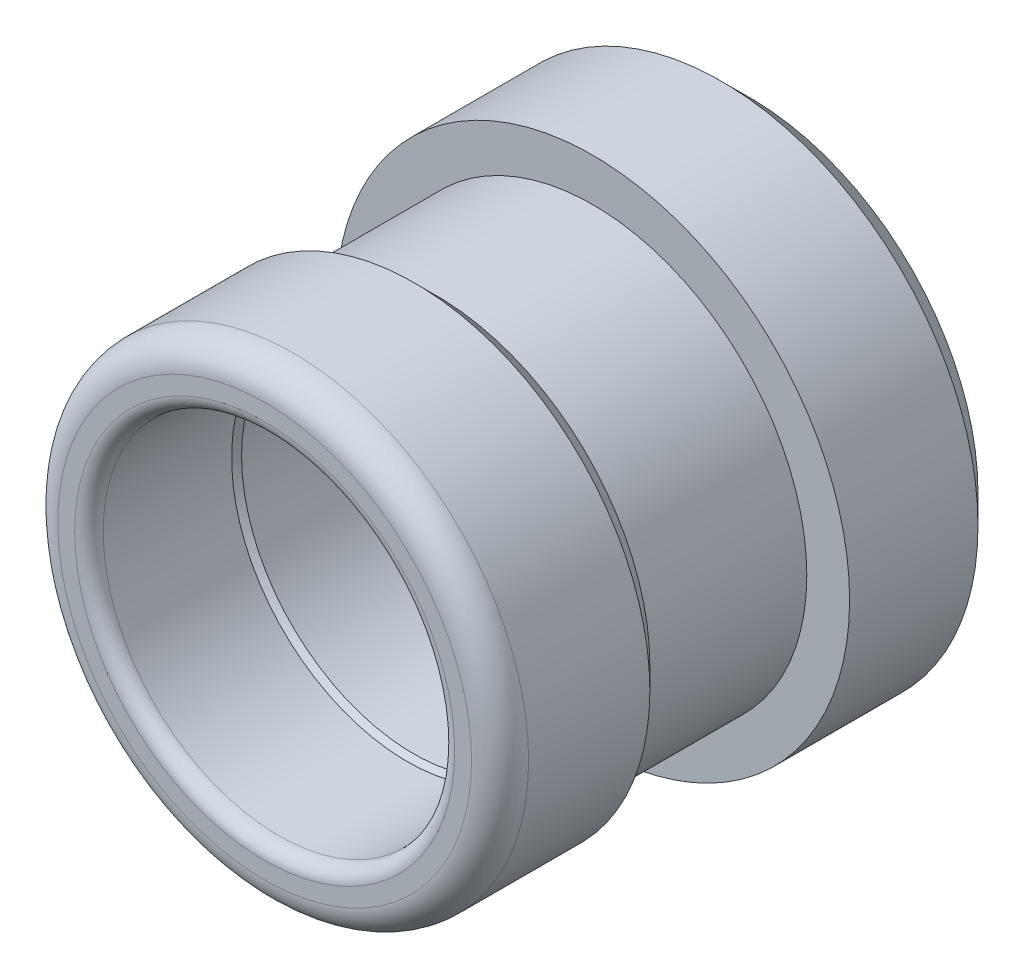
ISO-10303-21;
HEADER;
FILE_DESCRIPTION(('STEP AP214'),'2;1');
FILE_NAME('part.step','',(''),(''),'','','');
FILE_SCHEMA(('AUTOMOTIVE_DESIGN { 1 0 10303 214 1 1 1 1 }'));
ENDSEC;
DATA;
#1=APPLICATION_CONTEXT('core data for automotive mechanical design processes');
#2=APPLICATION_PROTOCOL_DEFINITION('international standard','automotive_design',2000,#1);
#3=PRODUCT_CONTEXT('',#1,'mechanical');
#4=PRODUCT('Part','Part','',(#3));
#5=PRODUCT_RELATED_PRODUCT_CATEGORY('part','',(#4));
#6=PRODUCT_DEFINITION_FORMATION('','',#4);
#7=PRODUCT_DEFINITION_CONTEXT('part definition',#1,'design');
#8=PRODUCT_DEFINITION('design','',#6,#7);
#9=PRODUCT_DEFINITION_SHAPE('','',#8);
#10=(LENGTH_UNIT() NAMED_UNIT(*) SI_UNIT(.MILLI.,.METRE.));
#11=(NAMED_UNIT(*) PLANE_ANGLE_UNIT() SI_UNIT($,.RADIAN.));
#12=(NAMED_UNIT(*) SI_UNIT($,.STERADIAN.) SOLID_ANGLE_UNIT());
#13=UNCERTAINTY_MEASURE_WITH_UNIT(LENGTH_MEASURE(1.E-05),#10,'distance_accuracy_value','');
#14=(GEOMETRIC_REPRESENTATION_CONTEXT(3) GLOBAL_UNCERTAINTY_ASSIGNED_CONTEXT((#13)) GLOBAL_UNIT_ASSIGNED_CONTEXT((#10,
#11,#12)) REPRESENTATION_CONTEXT('',''));
#15=CARTESIAN_POINT('',(0.,0.,0.));
#16=DIRECTION('',(0.,0.,1.));
#17=DIRECTION('',(1.,0.,0.));
#18=AXIS2_PLACEMENT_3D('',#15,#16,#17);
#19=CARTESIAN_POINT('',(0.,0.,13.49375));
#20=DIRECTION('',(0.,0.,1.));
#21=DIRECTION('',(1.,0.,0.));
#22=AXIS2_PLACEMENT_3D('',#19,#20,#21);
#23=PLANE('',#22);
#24=CARTESIAN_POINT('',(0.,0.,13.49375));
#25=DIRECTION('',(0.,0.,1.));
#26=DIRECTION('',(1.,0.,0.));
#27=AXIS2_PLACEMENT_3D('',#24,#25,#26);
#28=CIRCLE('',#27,10.57275);
#29=CARTESIAN_POINT('',(10.57275,0.,13.49375));
#30=VERTEX_POINT('',#29);
#31=EDGE_CURVE('E10',#30,#30,#28,.F.);
#32=ORIENTED_EDGE('',*,*,#31,.T.);
#33=EDGE_LOOP('',(#32));
#34=FACE_BOUND('',#33,.T.);
#35=CARTESIAN_POINT('',(0.,0.,13.49375));
#36=DIRECTION('',(0.,0.,1.));
#37=DIRECTION('',(1.,0.,0.));
#38=AXIS2_PLACEMENT_3D('',#35,#36,#37);
#39=CIRCLE('',#38,11.509375);
#40=CARTESIAN_POINT('',(11.509375,0.,13.49375));
#41=VERTEX_POINT('',#40);
#42=EDGE_CURVE('E44',#41,#41,#39,.T.);
#43=ORIENTED_EDGE('',*,*,#42,.T.);
#44=EDGE_LOOP('',(#43));
#45=FACE_BOUND('',#44,.T.);
#46=ADVANCED_FACE('F29',(#34,#45),#23,.T.);
#47=CARTESIAN_POINT('',(0.,-14.2875,-13.49375));
#48=DIRECTION('',(0.,0.,-1.));
#49=DIRECTION('',(-1.,0.,0.));
#50=AXIS2_PLACEMENT_3D('',#47,#48,#49);
#51=PLANE('',#50);
#52=CARTESIAN_POINT('',(0.,0.,-13.49375));
#53=DIRECTION('',(0.,0.,-1.));
#54=DIRECTION('',(-1.,0.,0.));
#55=AXIS2_PLACEMENT_3D('',#52,#53,#54);
#56=CIRCLE('',#55,12.7);
#57=CARTESIAN_POINT('',(12.7,0.,-13.49375));
#58=VERTEX_POINT('',#57);
#59=EDGE_CURVE('E49',#58,#58,#56,.T.);
#60=ORIENTED_EDGE('',*,*,#59,.T.);
#61=EDGE_LOOP('',(#60));
#62=FACE_BOUND('',#61,.T.);
#63=CARTESIAN_POINT('',(0.,0.,-13.49375));
#64=DIRECTION('',(0.,0.,1.));
#65=DIRECTION('',(1.,0.,0.));
#66=AXIS2_PLACEMENT_3D('',#63,#64,#65);
#67=CIRCLE('',#66,9.5758);
#68=CARTESIAN_POINT('',(9.5758,0.,-13.49375));
#69=VERTEX_POINT('',#68);
#70=EDGE_CURVE('E79',#69,#69,#67,.T.);
#71=ORIENTED_EDGE('',*,*,#70,.T.);
#72=EDGE_LOOP('',(#71));
#73=FACE_BOUND('',#72,.T.);
#74=ADVANCED_FACE('F112',(#62,#73),#51,.T.);
#75=CARTESIAN_POINT('',(0.,0.,20.5573598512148));
#76=DIRECTION('',(0.,0.,1.));
#77=DIRECTION('',(1.,0.,0.));
#78=AXIS2_PLACEMENT_3D('',#75,#76,#77);
#79=CYLINDRICAL_SURFACE('',#78,13.096875);
#80=CARTESIAN_POINT('',(0.,0.,11.90625));
#81=DIRECTION('',(0.,0.,1.));
#82=DIRECTION('',(1.,0.,0.));
#83=AXIS2_PLACEMENT_3D('',#80,#81,#82);
#84=CIRCLE('',#83,13.096875);
#85=CARTESIAN_POINT('',(13.096875,0.,11.90625));
#86=VERTEX_POINT('',#85);
#87=EDGE_CURVE('E40',#86,#86,#84,.F.);
#88=ORIENTED_EDGE('',*,*,#87,.T.);
#89=EDGE_LOOP('',(#88));
#90=FACE_BOUND('',#89,.T.);
#91=CARTESIAN_POINT('',(0.,0.,5.15937499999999));
#92=DIRECTION('',(0.,0.,1.));
#93=DIRECTION('',(1.,0.,0.));
#94=AXIS2_PLACEMENT_3D('',#91,#92,#93);
#95=CIRCLE('',#94,13.096875);
#96=CARTESIAN_POINT('',(13.096875,0.,5.15937499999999));
#97=VERTEX_POINT('',#96);
#98=EDGE_CURVE('E67',#97,#97,#95,.T.);
#99=ORIENTED_EDGE('',*,*,#98,.T.);
#100=EDGE_LOOP('',(#99));
#101=FACE_BOUND('',#100,.T.);
#102=ADVANCED_FACE('F117',(#90,#101),#79,.T.);
#103=CARTESIAN_POINT('',(0.,0.,5.15937499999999));
#104=DIRECTION('',(0.,0.,1.));
#105=DIRECTION('',(1.,0.,0.));
#106=AXIS2_PLACEMENT_3D('',#103,#104,#105);
#107=CONICAL_SURFACE('',#106,13.096875,0.785398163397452);
#108=CARTESIAN_POINT('',(0.,0.,3.96875));
#109=DIRECTION('',(0.,0.,1.));
#110=DIRECTION('',(1.,0.,0.));
#111=AXIS2_PLACEMENT_3D('',#108,#109,#110);
#112=CIRCLE('',#111,11.90625);
#113=CARTESIAN_POINT('',(11.90625,0.,3.96875));
#114=VERTEX_POINT('',#113);
#115=EDGE_CURVE('E70',#114,#114,#112,.T.);
#116=ORIENTED_EDGE('',*,*,#115,.T.);
#117=EDGE_LOOP('',(#116));
#118=FACE_BOUND('',#117,.T.);
#119=ORIENTED_EDGE('',*,*,#98,.F.);
#120=EDGE_LOOP('',(#119));
#121=FACE_BOUND('',#120,.T.);
#122=ADVANCED_FACE('F143',(#118,#121),#107,.T.);
#123=CARTESIAN_POINT('',(0.,0.,20.5573598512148));
#124=DIRECTION('',(0.,0.,1.));
#125=DIRECTION('',(1.,0.,0.));
#126=AXIS2_PLACEMENT_3D('',#123,#124,#125);
#127=CYLINDRICAL_SURFACE('',#126,11.90625);
#128=CARTESIAN_POINT('',(0.,0.,-4.7625));
#129=DIRECTION('',(0.,0.,1.));
#130=DIRECTION('',(1.,0.,0.));
#131=AXIS2_PLACEMENT_3D('',#128,#129,#130);
#132=CIRCLE('',#131,11.90625);
#133=CARTESIAN_POINT('',(11.90625,0.,-4.7625));
#134=VERTEX_POINT('',#133);
#135=EDGE_CURVE('E73',#134,#134,#132,.T.);
#136=ORIENTED_EDGE('',*,*,#135,.T.);
#137=EDGE_LOOP('',(#136));
#138=FACE_BOUND('',#137,.T.);
#139=ORIENTED_EDGE('',*,*,#115,.F.);
#140=EDGE_LOOP('',(#139));
#141=FACE_BOUND('',#140,.T.);
#142=ADVANCED_FACE('F147',(#138,#141),#127,.T.);
#143=CARTESIAN_POINT('',(0.,-11.90625,-4.7625));
#144=DIRECTION('',(0.,0.,1.));
#145=DIRECTION('',(1.,0.,0.));
#146=AXIS2_PLACEMENT_3D('',#143,#144,#145);
#147=PLANE('',#146);
#148=CARTESIAN_POINT('',(0.,0.,-4.7625));
#149=DIRECTION('',(0.,0.,1.));
#150=DIRECTION('',(1.,0.,0.));
#151=AXIS2_PLACEMENT_3D('',#148,#149,#150);
#152=CIRCLE('',#151,14.2875);
#153=CARTESIAN_POINT('',(14.2875,0.,-4.7625));
#154=VERTEX_POINT('',#153);
#155=EDGE_CURVE('E76',#154,#154,#152,.T.);
#156=ORIENTED_EDGE('',*,*,#155,.T.);
#157=EDGE_LOOP('',(#156));
#158=FACE_BOUND('',#157,.T.);
#159=ORIENTED_EDGE('',*,*,#135,.F.);
#160=EDGE_LOOP('',(#159));
#161=FACE_BOUND('',#160,.T.);
#162=ADVANCED_FACE('F152',(#158,#161),#147,.T.);
#163=CARTESIAN_POINT('',(0.,0.,20.5573598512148));
#164=DIRECTION('',(0.,0.,1.));
#165=DIRECTION('',(1.,0.,0.));
#166=AXIS2_PLACEMENT_3D('',#163,#164,#165);
#167=CYLINDRICAL_SURFACE('',#166,14.2875);
#168=CARTESIAN_POINT('',(0.,0.,-11.90625));
#169=DIRECTION('',(0.,0.,-1.));
#170=DIRECTION('',(-1.,0.,0.));
#171=AXIS2_PLACEMENT_3D('',#168,#169,#170);
#172=CIRCLE('',#171,14.2875);
#173=CARTESIAN_POINT('',(14.2875,0.,-11.90625));
#174=VERTEX_POINT('',#173);
#175=EDGE_CURVE('E52',#174,#174,#172,.F.);
#176=ORIENTED_EDGE('',*,*,#175,.T.);
#177=EDGE_LOOP('',(#176));
#178=FACE_BOUND('',#177,.T.);
#179=ORIENTED_EDGE('',*,*,#155,.F.);
#180=EDGE_LOOP('',(#179));
#181=FACE_BOUND('',#180,.T.);
#182=ADVANCED_FACE('F158',(#178,#181),#167,.T.);
#183=CARTESIAN_POINT('',(0.,0.,19.5863417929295));
#184=DIRECTION('',(0.,0.,1.));
#185=DIRECTION('',(1.,0.,0.));
#186=AXIS2_PLACEMENT_3D('',#183,#184,#185);
#187=CYLINDRICAL_SURFACE('',#186,9.5758);
#188=CARTESIAN_POINT('',(0.,0.,-12.303125));
#189=DIRECTION('',(0.,0.,1.));
#190=DIRECTION('',(1.,0.,0.));
#191=AXIS2_PLACEMENT_3D('',#188,#189,#190);
#192=CIRCLE('',#191,9.5758);
#193=CARTESIAN_POINT('',(9.5758,0.,-12.303125));
#194=VERTEX_POINT('',#193);
#195=EDGE_CURVE('E82',#194,#194,#192,.T.);
#196=ORIENTED_EDGE('',*,*,#195,.T.);
#197=EDGE_LOOP('',(#196));
#198=FACE_BOUND('',#197,.T.);
#199=ORIENTED_EDGE('',*,*,#70,.F.);
#200=EDGE_LOOP('',(#199));
#201=FACE_BOUND('',#200,.T.);
#202=ADVANCED_FACE('F161',(#198,#201),#187,.F.);
#203=CARTESIAN_POINT('',(0.,12.5984,-12.303125));
#204=DIRECTION('',(0.,0.,1.));
#205=DIRECTION('',(1.,0.,0.));
#206=AXIS2_PLACEMENT_3D('',#203,#204,#205);
#207=PLANE('',#206);
#208=CARTESIAN_POINT('',(0.,0.,-12.303125));
#209=DIRECTION('',(0.,0.,1.));
#210=DIRECTION('',(1.,0.,0.));
#211=AXIS2_PLACEMENT_3D('',#208,#209,#210);
#212=CIRCLE('',#211,11.80465);
#213=CARTESIAN_POINT('',(11.80465,0.,-12.303125));
#214=VERTEX_POINT('',#213);
#215=EDGE_CURVE('E55',#214,#214,#212,.T.);
#216=ORIENTED_EDGE('',*,*,#215,.T.);
#217=EDGE_LOOP('',(#216));
#218=FACE_BOUND('',#217,.T.);
#219=ORIENTED_EDGE('',*,*,#195,.F.);
#220=EDGE_LOOP('',(#219));
#221=FACE_BOUND('',#220,.T.);
#222=ADVANCED_FACE('F166',(#218,#221),#207,.T.);
#223=CARTESIAN_POINT('',(0.,0.,19.5863417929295));
#224=DIRECTION('',(0.,0.,1.));
#225=DIRECTION('',(1.,0.,0.));
#226=AXIS2_PLACEMENT_3D('',#223,#224,#225);
#227=CYLINDRICAL_SURFACE('',#226,12.5984);
#228=CARTESIAN_POINT('',(0.,0.,-8.32167499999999));
#229=DIRECTION('',(0.,0.,-1.));
#230=DIRECTION('',(-1.,0.,0.));
#231=AXIS2_PLACEMENT_3D('',#228,#229,#230);
#232=CIRCLE('',#231,12.5984);
#233=CARTESIAN_POINT('',(-12.5984,0.,-8.32167499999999));
#234=VERTEX_POINT('',#233);
#235=EDGE_CURVE('E61',#234,#234,#232,.F.);
#236=ORIENTED_EDGE('',*,*,#235,.T.);
#237=EDGE_LOOP('',(#236));
#238=FACE_BOUND('',#237,.T.);
#239=CARTESIAN_POINT('',(0.,0.,-11.509375));
#240=DIRECTION('',(0.,0.,1.));
#241=DIRECTION('',(1.,0.,0.));
#242=AXIS2_PLACEMENT_3D('',#239,#240,#241);
#243=CIRCLE('',#242,12.5984);
#244=CARTESIAN_POINT('',(12.5984,0.,-11.509375));
#245=VERTEX_POINT('',#244);
#246=EDGE_CURVE('E64',#245,#245,#243,.F.);
#247=ORIENTED_EDGE('',*,*,#246,.T.);
#248=EDGE_LOOP('',(#247));
#249=FACE_BOUND('',#248,.T.);
#250=ADVANCED_FACE('F170',(#238,#249),#227,.F.);
#251=CARTESIAN_POINT('',(0.,9.5758,-7.52792499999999));
#252=DIRECTION('',(0.,0.,-1.));
#253=DIRECTION('',(-1.,0.,0.));
#254=AXIS2_PLACEMENT_3D('',#251,#252,#253);
#255=PLANE('',#254);
#256=CARTESIAN_POINT('',(0.,0.,-7.52792499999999));
#257=DIRECTION('',(0.,0.,-1.));
#258=DIRECTION('',(-1.,0.,0.));
#259=AXIS2_PLACEMENT_3D('',#256,#257,#258);
#260=CIRCLE('',#259,11.80465);
#261=CARTESIAN_POINT('',(-11.80465,0.,-7.52792499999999));
#262=VERTEX_POINT('',#261);
#263=EDGE_CURVE('E58',#262,#262,#260,.T.);
#264=ORIENTED_EDGE('',*,*,#263,.T.);
#265=EDGE_LOOP('',(#264));
#266=FACE_BOUND('',#265,.T.);
#267=CARTESIAN_POINT('',(0.,0.,-7.527925));
#268=DIRECTION('',(0.,0.,1.));
#269=DIRECTION('',(1.,0.,0.));
#270=AXIS2_PLACEMENT_3D('',#267,#268,#269);
#271=CIRCLE('',#270,9.5758);
#272=CARTESIAN_POINT('',(9.5758,0.,-7.527925));
#273=VERTEX_POINT('',#272);
#274=EDGE_CURVE('E85',#273,#273,#271,.T.);
#275=ORIENTED_EDGE('',*,*,#274,.T.);
#276=EDGE_LOOP('',(#275));
#277=FACE_BOUND('',#276,.T.);
#278=ADVANCED_FACE('F174',(#266,#277),#255,.T.);
#279=CARTESIAN_POINT('',(0.,0.,19.5863417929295));
#280=DIRECTION('',(0.,0.,1.));
#281=DIRECTION('',(1.,0.,0.));
#282=AXIS2_PLACEMENT_3D('',#279,#280,#281);
#283=CYLINDRICAL_SURFACE('',#282,9.5758);
#284=CARTESIAN_POINT('',(0.,0.,5.20429727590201));
#285=DIRECTION('',(0.,0.,1.));
#286=DIRECTION('',(1.,0.,0.));
#287=AXIS2_PLACEMENT_3D('',#284,#285,#286);
#288=CIRCLE('',#287,9.5758);
#289=CARTESIAN_POINT('',(9.5758,0.,5.20429727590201));
#290=VERTEX_POINT('',#289);
#291=EDGE_CURVE('E88',#290,#290,#288,.T.);
#292=ORIENTED_EDGE('',*,*,#291,.T.);
#293=EDGE_LOOP('',(#292));
#294=FACE_BOUND('',#293,.T.);
#295=ORIENTED_EDGE('',*,*,#274,.F.);
#296=EDGE_LOOP('',(#295));
#297=FACE_BOUND('',#296,.T.);
#298=ADVANCED_FACE('F109',(#294,#297),#283,.F.);
#299=CARTESIAN_POINT('',(0.,0.,5.20429727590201));
#300=DIRECTION('',(0.,0.,1.));
#301=DIRECTION('',(1.,0.,0.));
#302=AXIS2_PLACEMENT_3D('',#299,#300,#301);
#303=CONICAL_SURFACE('',#302,9.5758,0.523598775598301);
#304=CARTESIAN_POINT('',(0.,0.,5.55625));
#305=DIRECTION('',(0.,0.,1.));
#306=DIRECTION('',(1.,0.,0.));
#307=AXIS2_PLACEMENT_3D('',#304,#305,#306);
#308=CIRCLE('',#307,9.779);
#309=CARTESIAN_POINT('',(9.779,0.,5.55625));
#310=VERTEX_POINT('',#309);
#311=EDGE_CURVE('E91',#310,#310,#308,.T.);
#312=ORIENTED_EDGE('',*,*,#311,.T.);
#313=EDGE_LOOP('',(#312));
#314=FACE_BOUND('',#313,.T.);
#315=ORIENTED_EDGE('',*,*,#291,.F.);
#316=EDGE_LOOP('',(#315));
#317=FACE_BOUND('',#316,.T.);
#318=ADVANCED_FACE('F95',(#314,#317),#303,.F.);
#319=CARTESIAN_POINT('',(0.,0.,19.5863417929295));
#320=DIRECTION('',(0.,0.,1.));
#321=DIRECTION('',(1.,0.,0.));
#322=AXIS2_PLACEMENT_3D('',#319,#320,#321);
#323=CYLINDRICAL_SURFACE('',#322,9.779);
#324=CARTESIAN_POINT('',(0.,0.,12.7));
#325=DIRECTION('',(0.,0.,1.));
#326=DIRECTION('',(1.,0.,0.));
#327=AXIS2_PLACEMENT_3D('',#324,#325,#326);
#328=CIRCLE('',#327,9.779);
#329=CARTESIAN_POINT('',(9.779,0.,12.7));
#330=VERTEX_POINT('',#329);
#331=EDGE_CURVE('E36',#330,#330,#328,.T.);
#332=ORIENTED_EDGE('',*,*,#331,.T.);
#333=EDGE_LOOP('',(#332));
#334=FACE_BOUND('',#333,.T.);
#335=ORIENTED_EDGE('',*,*,#311,.F.);
#336=EDGE_LOOP('',(#335));
#337=FACE_BOUND('',#336,.T.);
#338=ADVANCED_FACE('F98',(#334,#337),#323,.F.);
#339=CARTESIAN_POINT('',(0.,0.,-8.32167499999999));
#340=DIRECTION('',(0.,0.,-1.));
#341=DIRECTION('',(-1.,0.,0.));
#342=AXIS2_PLACEMENT_3D('',#339,#340,#341);
#343=TOROIDAL_SURFACE('',#342,11.80465,0.79375);
#344=ORIENTED_EDGE('',*,*,#263,.F.);
#345=EDGE_LOOP('',(#344));
#346=FACE_BOUND('',#345,.T.);
#347=ORIENTED_EDGE('',*,*,#235,.F.);
#348=EDGE_LOOP('',(#347));
#349=FACE_BOUND('',#348,.T.);
#350=ADVANCED_FACE('F100',(#346,#349),#343,.F.);
#351=CARTESIAN_POINT('',(0.,0.,-11.509375));
#352=DIRECTION('',(0.,0.,1.));
#353=DIRECTION('',(1.,0.,0.));
#354=AXIS2_PLACEMENT_3D('',#351,#352,#353);
#355=TOROIDAL_SURFACE('',#354,11.80465,0.79375);
#356=ORIENTED_EDGE('',*,*,#246,.F.);
#357=EDGE_LOOP('',(#356));
#358=FACE_BOUND('',#357,.T.);
#359=ORIENTED_EDGE('',*,*,#215,.F.);
#360=EDGE_LOOP('',(#359));
#361=FACE_BOUND('',#360,.T.);
#362=ADVANCED_FACE('F106',(#358,#361),#355,.F.);
#363=CARTESIAN_POINT('',(0.,0.,-11.90625));
#364=DIRECTION('',(0.,0.,1.));
#365=DIRECTION('',(1.,0.,0.));
#366=AXIS2_PLACEMENT_3D('',#363,#364,#365);
#367=CONICAL_SURFACE('',#366,14.2875,0.785398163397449);
#368=CARTESIAN_POINT('',(12.7,0.,-13.49375));
#369=CARTESIAN_POINT('',(12.7165364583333,0.,-13.4772135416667));
#370=CARTESIAN_POINT('',(12.7330729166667,0.,-13.4606770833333));
#371=CARTESIAN_POINT('',(12.7661458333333,0.,-13.4276041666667));
#372=CARTESIAN_POINT('',(12.7826822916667,0.,-13.4110677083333));
#373=CARTESIAN_POINT('',(12.8157552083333,0.,-13.3779947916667));
#374=CARTESIAN_POINT('',(12.8322916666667,0.,-13.3614583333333));
#375=CARTESIAN_POINT('',(12.8653645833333,0.,-13.3283854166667));
#376=CARTESIAN_POINT('',(12.8819010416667,0.,-13.3118489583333));
#377=CARTESIAN_POINT('',(12.9149739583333,0.,-13.2787760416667));
#378=CARTESIAN_POINT('',(12.9315104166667,0.,-13.2622395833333));
#379=CARTESIAN_POINT('',(12.9645833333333,0.,-13.2291666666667));
#380=CARTESIAN_POINT('',(12.9811197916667,0.,-13.2126302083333));
#381=CARTESIAN_POINT('',(13.0141927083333,0.,-13.1795572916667));
#382=CARTESIAN_POINT('',(13.0307291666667,0.,-13.1630208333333));
#383=CARTESIAN_POINT('',(13.0638020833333,0.,-13.1299479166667));
#384=CARTESIAN_POINT('',(13.0803385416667,0.,-13.1134114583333));
#385=CARTESIAN_POINT('',(13.1134114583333,0.,-13.0803385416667));
#386=CARTESIAN_POINT('',(13.1299479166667,0.,-13.0638020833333));
#387=CARTESIAN_POINT('',(13.1630208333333,0.,-13.0307291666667));
#388=CARTESIAN_POINT('',(13.1795572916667,0.,-13.0141927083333));
#389=CARTESIAN_POINT('',(13.2126302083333,0.,-12.9811197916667));
#390=CARTESIAN_POINT('',(13.2291666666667,0.,-12.9645833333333));
#391=CARTESIAN_POINT('',(13.2622395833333,0.,-12.9315104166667));
#392=CARTESIAN_POINT('',(13.2787760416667,0.,-12.9149739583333));
#393=CARTESIAN_POINT('',(13.3118489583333,0.,-12.8819010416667));
#394=CARTESIAN_POINT('',(13.3283854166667,0.,-12.8653645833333));
#395=CARTESIAN_POINT('',(13.3614583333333,0.,-12.8322916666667));
#396=CARTESIAN_POINT('',(13.3779947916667,0.,-12.8157552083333));
#397=CARTESIAN_POINT('',(13.4110677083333,0.,-12.7826822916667));
#398=CARTESIAN_POINT('',(13.4276041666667,0.,-12.7661458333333));
#399=CARTESIAN_POINT('',(13.4606770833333,0.,-12.7330729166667));
#400=CARTESIAN_POINT('',(13.4772135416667,0.,-12.7165364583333));
#401=CARTESIAN_POINT('',(13.5102864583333,0.,-12.6834635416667));
#402=CARTESIAN_POINT('',(13.5268229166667,0.,-12.6669270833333));
#403=CARTESIAN_POINT('',(13.5598958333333,0.,-12.6338541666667));
#404=CARTESIAN_POINT('',(13.5764322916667,0.,-12.6173177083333));
#405=CARTESIAN_POINT('',(13.6095052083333,0.,-12.5842447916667));
#406=CARTESIAN_POINT('',(13.6260416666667,0.,-12.5677083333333));
#407=CARTESIAN_POINT('',(13.6591145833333,0.,-12.5346354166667));
#408=CARTESIAN_POINT('',(13.6756510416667,0.,-12.5180989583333));
#409=CARTESIAN_POINT('',(13.7087239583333,0.,-12.4850260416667));
#410=CARTESIAN_POINT('',(13.7252604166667,0.,-12.4684895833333));
#411=CARTESIAN_POINT('',(13.7583333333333,0.,-12.4354166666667));
#412=CARTESIAN_POINT('',(13.7748697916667,0.,-12.4188802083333));
#413=CARTESIAN_POINT('',(13.8079427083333,0.,-12.3858072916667));
#414=CARTESIAN_POINT('',(13.8244791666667,0.,-12.3692708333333));
#415=CARTESIAN_POINT('',(13.8575520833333,0.,-12.3361979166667));
#416=CARTESIAN_POINT('',(13.8740885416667,0.,-12.3196614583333));
#417=CARTESIAN_POINT('',(13.9071614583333,0.,-12.2865885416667));
#418=CARTESIAN_POINT('',(13.9236979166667,0.,-12.2700520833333));
#419=CARTESIAN_POINT('',(13.9567708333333,0.,-12.2369791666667));
#420=CARTESIAN_POINT('',(13.9733072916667,0.,-12.2204427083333));
#421=CARTESIAN_POINT('',(14.0063802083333,0.,-12.1873697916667));
#422=CARTESIAN_POINT('',(14.0229166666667,0.,-12.1708333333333));
#423=CARTESIAN_POINT('',(14.0559895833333,0.,-12.1377604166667));
#424=CARTESIAN_POINT('',(14.0725260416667,0.,-12.1212239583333));
#425=CARTESIAN_POINT('',(14.1055989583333,0.,-12.0881510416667));
#426=CARTESIAN_POINT('',(14.1221354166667,0.,-12.0716145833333));
#427=CARTESIAN_POINT('',(14.1552083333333,0.,-12.0385416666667));
#428=CARTESIAN_POINT('',(14.1717447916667,0.,-12.0220052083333));
#429=CARTESIAN_POINT('',(14.2048177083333,0.,-11.9889322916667));
#430=CARTESIAN_POINT('',(14.2213541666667,0.,-11.9723958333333));
#431=CARTESIAN_POINT('',(14.2544270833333,0.,-11.9393229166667));
#432=CARTESIAN_POINT('',(14.2709635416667,0.,-11.9227864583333));
#433=CARTESIAN_POINT('',(14.2875,0.,-11.90625));
#434=B_SPLINE_CURVE_WITH_KNOTS('',3,(#368,#369,#370,#371,#372,#373,#374,#375,#376,#377,#378,
#379,#380,#381,#382,#383,#384,#385,#386,#387,#388,#389,#390,#391,#392,#393,#394,#395,#396,#397,
#398,#399,#400,#401,#402,#403,#404,#405,#406,#407,#408,#409,#410,#411,#412,#413,#414,#415,#416,
#417,#418,#419,#420,#421,#422,#423,#424,#425,#426,#427,#428,#429,#430,#431,#432,#433),
.UNSPECIFIED.,.F.,.F.,(4,2,2,2,2,2,2,2,2,2,2,2,2,2,2,2,2,2,2,2,2,2,2,2,2,2,2,2,2,2,2,2,4),(0.,
0.0701582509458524,0.140316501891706,0.21047475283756,0.280633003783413,0.350791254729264,
0.420949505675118,0.491107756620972,0.561266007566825,0.631424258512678,0.70158250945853,
0.771740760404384,0.841899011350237,0.91205726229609,0.982215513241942,1.0523737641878,
1.12253201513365,1.1926902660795,1.26284851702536,1.33300676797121,1.40316501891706,
1.47332326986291,1.54348152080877,1.61363977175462,1.68379802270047,1.75395627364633,
1.82411452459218,1.89427277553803,1.96443102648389,2.03458927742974,2.10474752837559,
2.17490577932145,2.2450640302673),.UNSPECIFIED.);
#435=EDGE_CURVE('BSEAM126',#58,#174,#434,.T.);
#436=ORIENTED_EDGE('',*,*,#59,.F.);
#437=ORIENTED_EDGE('',*,*,#175,.F.);
#438=ORIENTED_EDGE('',*,*,#435,.T.);
#439=ORIENTED_EDGE('',*,*,#435,.F.);
#440=EDGE_LOOP('',(#436,#438,#437,#439));
#441=FACE_BOUND('',#440,.T.);
#442=ADVANCED_FACE('F126',(#441),#367,.T.);
#443=CARTESIAN_POINT('',(0.,0.,11.90625));
#444=DIRECTION('',(0.,0.,1.));
#445=DIRECTION('',(1.,0.,0.));
#446=AXIS2_PLACEMENT_3D('',#443,#444,#445);
#447=TOROIDAL_SURFACE('',#446,11.509375,1.5875);
#448=ORIENTED_EDGE('',*,*,#87,.F.);
#449=EDGE_LOOP('',(#448));
#450=FACE_BOUND('',#449,.T.);
#451=ORIENTED_EDGE('',*,*,#42,.F.);
#452=EDGE_LOOP('',(#451));
#453=FACE_BOUND('',#452,.T.);
#454=ADVANCED_FACE('F129',(#450,#453),#447,.T.);
#455=CARTESIAN_POINT('',(0.,0.,12.7));
#456=DIRECTION('',(0.,0.,1.));
#457=DIRECTION('',(1.,0.,0.));
#458=AXIS2_PLACEMENT_3D('',#455,#456,#457);
#459=TOROIDAL_SURFACE('',#458,10.57275,0.79375);
#460=ORIENTED_EDGE('',*,*,#31,.F.);
#461=EDGE_LOOP('',(#460));
#462=FACE_BOUND('',#461,.T.);
#463=ORIENTED_EDGE('',*,*,#331,.F.);
#464=EDGE_LOOP('',(#463));
#465=FACE_BOUND('',#464,.T.);
#466=ADVANCED_FACE('F31',(#462,#465),#459,.T.);
#467=CLOSED_SHELL('',(#46,#74,#102,#122,#142,#162,#182,#202,#222,#250,#278,#298,#318,#338,#350,
#362,#442,#454,#466));
#468=MANIFOLD_SOLID_BREP('B2',#467);
#469=ADVANCED_BREP_SHAPE_REPRESENTATION('',(#18,#468),#14);
#470=SHAPE_DEFINITION_REPRESENTATION(#9,#469);
ENDSEC;
END-ISO-10303-21;
